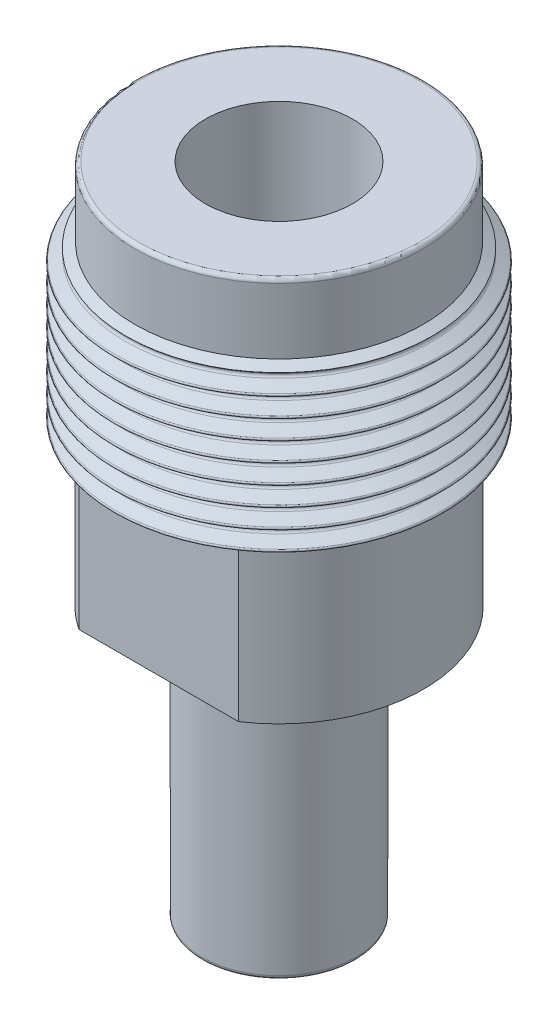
ISO-10303-21;
HEADER;
FILE_DESCRIPTION(('STEP AP214'),'2;1');
FILE_NAME('part.step','',(''),(''),'','','');
FILE_SCHEMA(('AUTOMOTIVE_DESIGN { 1 0 10303 214 1 1 1 1 }'));
ENDSEC;
DATA;
#1=APPLICATION_CONTEXT('core data for automotive mechanical design processes');
#2=APPLICATION_PROTOCOL_DEFINITION('international standard','automotive_design',2000,#1);
#3=PRODUCT_CONTEXT('',#1,'mechanical');
#4=PRODUCT('Part','Part','',(#3));
#5=PRODUCT_RELATED_PRODUCT_CATEGORY('part','',(#4));
#6=PRODUCT_DEFINITION_FORMATION('','',#4);
#7=PRODUCT_DEFINITION_CONTEXT('part definition',#1,'design');
#8=PRODUCT_DEFINITION('design','',#6,#7);
#9=PRODUCT_DEFINITION_SHAPE('','',#8);
#10=(LENGTH_UNIT() NAMED_UNIT(*) SI_UNIT(.MILLI.,.METRE.));
#11=(NAMED_UNIT(*) PLANE_ANGLE_UNIT() SI_UNIT($,.RADIAN.));
#12=(NAMED_UNIT(*) SI_UNIT($,.STERADIAN.) SOLID_ANGLE_UNIT());
#13=UNCERTAINTY_MEASURE_WITH_UNIT(LENGTH_MEASURE(1.E-05),#10,'distance_accuracy_value','');
#14=(GEOMETRIC_REPRESENTATION_CONTEXT(3) GLOBAL_UNCERTAINTY_ASSIGNED_CONTEXT((#13)) GLOBAL_UNIT_ASSIGNED_CONTEXT((#10,
#11,#12)) REPRESENTATION_CONTEXT('',''));
#15=CARTESIAN_POINT('',(0.,0.,0.));
#16=DIRECTION('',(0.,0.,1.));
#17=DIRECTION('',(1.,0.,0.));
#18=AXIS2_PLACEMENT_3D('',#15,#16,#17);
#19=CARTESIAN_POINT('',(-2.4257,0.,0.));
#20=DIRECTION('',(0.,1.,0.));
#21=DIRECTION('',(0.,0.,1.));
#22=AXIS2_PLACEMENT_3D('',#19,#20,#21);
#23=PLANE('',#22);
#24=CARTESIAN_POINT('',(0.,0.,0.));
#25=DIRECTION('',(0.,1.,0.));
#26=DIRECTION('',(0.,0.,1.));
#27=AXIS2_PLACEMENT_3D('',#24,#25,#26);
#28=CIRCLE('',#27,4.6228);
#29=CARTESIAN_POINT('',(0.,0.,4.6228));
#30=VERTEX_POINT('',#29);
#31=EDGE_CURVE('E11',#30,#30,#28,.T.);
#32=ORIENTED_EDGE('',*,*,#31,.T.);
#33=EDGE_LOOP('',(#32));
#34=FACE_BOUND('',#33,.T.);
#35=CARTESIAN_POINT('',(0.,0.,0.));
#36=DIRECTION('',(0.,1.,0.));
#37=DIRECTION('',(0.,0.,1.));
#38=AXIS2_PLACEMENT_3D('',#35,#36,#37);
#39=CIRCLE('',#38,2.4257);
#40=CARTESIAN_POINT('',(0.,0.,2.4257));
#41=VERTEX_POINT('',#40);
#42=EDGE_CURVE('E96',#41,#41,#39,.T.);
#43=ORIENTED_EDGE('',*,*,#42,.F.);
#44=EDGE_LOOP('',(#43));
#45=FACE_BOUND('',#44,.T.);
#46=ADVANCED_FACE('F32',(#34,#45),#23,.T.);
#47=CARTESIAN_POINT('',(0.,-2.54,0.));
#48=DIRECTION('',(0.,-1.,0.));
#49=DIRECTION('',(0.,0.,-1.));
#50=AXIS2_PLACEMENT_3D('',#47,#48,#49);
#51=TOROIDAL_SURFACE('',#50,5.10210975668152,0.091654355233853);
#52=CARTESIAN_POINT('',(0.,-2.619375,0.));
#53=DIRECTION('',(0.,-1.,0.));
#54=DIRECTION('',(0.,0.,-1.));
#55=AXIS2_PLACEMENT_3D('',#52,#53,#54);
#56=CIRCLE('',#55,5.05628257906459);
#57=CARTESIAN_POINT('',(0.,-2.619375,-5.05628257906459));
#58=VERTEX_POINT('',#57);
#59=EDGE_CURVE('E191',#58,#58,#56,.T.);
#60=ORIENTED_EDGE('',*,*,#59,.F.);
#61=EDGE_LOOP('',(#60));
#62=FACE_BOUND('',#61,.T.);
#63=CARTESIAN_POINT('',(0.,-2.46180315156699,0.));
#64=DIRECTION('',(0.,-1.,0.));
#65=DIRECTION('',(0.,0.,-1.));
#66=AXIS2_PLACEMENT_3D('',#63,#64,#65);
#67=CIRCLE('',#66,5.05429999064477);
#68=CARTESIAN_POINT('',(0.,-2.46180315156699,-5.05429999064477));
#69=VERTEX_POINT('',#68);
#70=EDGE_CURVE('E79',#69,#69,#67,.T.);
#71=ORIENTED_EDGE('',*,*,#70,.T.);
#72=EDGE_LOOP('',(#71));
#73=FACE_BOUND('',#72,.T.);
#74=ADVANCED_FACE('F142',(#62,#73),#51,.F.);
#75=CARTESIAN_POINT('',(0.,0.,0.));
#76=DIRECTION('',(0.,1.,0.));
#77=DIRECTION('',(0.,0.,1.));
#78=AXIS2_PLACEMENT_3D('',#75,#76,#77);
#79=CYLINDRICAL_SURFACE('',#78,4.7625);
#80=CARTESIAN_POINT('',(0.,-7.62,0.));
#81=DIRECTION('',(0.,1.,0.));
#82=DIRECTION('',(0.,0.,1.));
#83=AXIS2_PLACEMENT_3D('',#80,#81,#82);
#84=CIRCLE('',#83,4.7625);
#85=CARTESIAN_POINT('',(-2.6325709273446,-7.62,-3.96875));
#86=VERTEX_POINT('',#85);
#87=CARTESIAN_POINT('',(-2.6325709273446,-7.62,3.96875));
#88=VERTEX_POINT('',#87);
#89=EDGE_CURVE('E97',#86,#88,#84,.T.);
#90=ORIENTED_EDGE('',*,*,#89,.F.);
#91=DIRECTION('',(0.,1.,0.));
#92=VECTOR('',#91,1.);
#93=CARTESIAN_POINT('',(-2.6325709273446,-15.24,-3.96875));
#94=LINE('',#93,#92);
#95=CARTESIAN_POINT('',(-2.6325709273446,-12.7,-3.96875));
#96=VERTEX_POINT('',#95);
#97=EDGE_CURVE('E77',#96,#86,#94,.T.);
#98=ORIENTED_EDGE('',*,*,#97,.F.);
#99=CARTESIAN_POINT('',(0.,-12.7,0.));
#100=DIRECTION('',(0.,1.,0.));
#101=DIRECTION('',(0.,0.,1.));
#102=AXIS2_PLACEMENT_3D('',#99,#100,#101);
#103=CIRCLE('',#102,4.7625);
#104=CARTESIAN_POINT('',(-2.6325709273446,-12.7,3.96875));
#105=VERTEX_POINT('',#104);
#106=EDGE_CURVE('E55',#96,#105,#103,.T.);
#107=ORIENTED_EDGE('',*,*,#106,.T.);
#108=DIRECTION('',(0.,1.,0.));
#109=VECTOR('',#108,1.);
#110=CARTESIAN_POINT('',(-2.6325709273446,-15.24,3.96875));
#111=LINE('',#110,#109);
#112=EDGE_CURVE('E285',#105,#88,#111,.T.);
#113=ORIENTED_EDGE('',*,*,#112,.T.);
#114=EDGE_LOOP('',(#90,#98,#107,#113));
#115=FACE_BOUND('',#114,.T.);
#116=ADVANCED_FACE('F148',(#115),#79,.T.);
#117=CARTESIAN_POINT('',(2.6325709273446,-12.7,3.96875));
#118=VERTEX_POINT('',#117);
#119=CARTESIAN_POINT('',(2.6325709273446,-12.7,-3.96875));
#120=VERTEX_POINT('',#119);
#121=EDGE_CURVE('E88',#118,#120,#103,.T.);
#122=ORIENTED_EDGE('',*,*,#121,.T.);
#123=DIRECTION('',(0.,1.,0.));
#124=VECTOR('',#123,1.);
#125=CARTESIAN_POINT('',(2.6325709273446,-15.24,-3.96875));
#126=LINE('',#125,#124);
#127=CARTESIAN_POINT('',(2.6325709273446,-7.62,-3.96875));
#128=VERTEX_POINT('',#127);
#129=EDGE_CURVE('E75',#120,#128,#126,.T.);
#130=ORIENTED_EDGE('',*,*,#129,.T.);
#131=CARTESIAN_POINT('',(2.6325709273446,-7.62,3.96875));
#132=VERTEX_POINT('',#131);
#133=EDGE_CURVE('E86',#132,#128,#84,.T.);
#134=ORIENTED_EDGE('',*,*,#133,.F.);
#135=DIRECTION('',(0.,1.,0.));
#136=VECTOR('',#135,1.);
#137=CARTESIAN_POINT('',(2.6325709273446,-15.24,3.96875));
#138=LINE('',#137,#136);
#139=EDGE_CURVE('E287',#118,#132,#138,.T.);
#140=ORIENTED_EDGE('',*,*,#139,.F.);
#141=EDGE_LOOP('',(#122,#130,#134,#140));
#142=FACE_BOUND('',#141,.T.);
#143=ADVANCED_FACE('F84',(#142),#79,.T.);
#144=CARTESIAN_POINT('',(-3.3274,-12.7,0.));
#145=DIRECTION('',(0.,-1.,0.));
#146=DIRECTION('',(0.,0.,-1.));
#147=AXIS2_PLACEMENT_3D('',#144,#145,#146);
#148=PLANE('',#147);
#149=CARTESIAN_POINT('',(0.,-12.7,0.));
#150=DIRECTION('',(0.,1.,0.));
#151=DIRECTION('',(0.,0.,1.));
#152=AXIS2_PLACEMENT_3D('',#149,#150,#151);
#153=CIRCLE('',#152,3.3274);
#154=CARTESIAN_POINT('',(0.,-12.7,3.3274));
#155=VERTEX_POINT('',#154);
#156=EDGE_CURVE('E181',#155,#155,#153,.T.);
#157=ORIENTED_EDGE('',*,*,#156,.T.);
#158=EDGE_LOOP('',(#157));
#159=FACE_BOUND('',#158,.T.);
#160=ORIENTED_EDGE('',*,*,#106,.F.);
#161=DIRECTION('',(1.,0.,0.));
#162=VECTOR('',#161,1.);
#163=CARTESIAN_POINT('',(-3.3274,-12.7,-3.96875));
#164=LINE('',#163,#162);
#165=EDGE_CURVE('E89',#96,#120,#164,.T.);
#166=ORIENTED_EDGE('',*,*,#165,.T.);
#167=ORIENTED_EDGE('',*,*,#121,.F.);
#168=DIRECTION('',(-1.,0.,0.));
#169=VECTOR('',#168,1.);
#170=CARTESIAN_POINT('',(-3.3274,-12.7,3.96875));
#171=LINE('',#170,#169);
#172=EDGE_CURVE('E100',#118,#105,#171,.T.);
#173=ORIENTED_EDGE('',*,*,#172,.T.);
#174=EDGE_LOOP('',(#160,#166,#167,#173));
#175=FACE_BOUND('',#174,.T.);
#176=ADVANCED_FACE('F447',(#159,#175),#148,.T.);
#177=CARTESIAN_POINT('',(-4.7625,-7.62,0.));
#178=DIRECTION('',(0.,-1.,0.));
#179=DIRECTION('',(0.,0.,-1.));
#180=AXIS2_PLACEMENT_3D('',#177,#178,#179);
#181=PLANE('',#180);
#182=ORIENTED_EDGE('',*,*,#133,.T.);
#183=DIRECTION('',(1.,0.,0.));
#184=VECTOR('',#183,1.);
#185=CARTESIAN_POINT('',(-2.6325709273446,-7.62,-3.96875));
#186=LINE('',#185,#184);
#187=EDGE_CURVE('E47',#86,#128,#186,.T.);
#188=ORIENTED_EDGE('',*,*,#187,.F.);
#189=ORIENTED_EDGE('',*,*,#89,.T.);
#190=DIRECTION('',(-1.,0.,0.));
#191=VECTOR('',#190,1.);
#192=CARTESIAN_POINT('',(-2.6325709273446,-7.62,3.96875));
#193=LINE('',#192,#191);
#194=EDGE_CURVE('E95',#132,#88,#193,.T.);
#195=ORIENTED_EDGE('',*,*,#194,.F.);
#196=EDGE_LOOP('',(#182,#188,#189,#195));
#197=FACE_BOUND('',#196,.T.);
#198=CARTESIAN_POINT('',(0.,-7.62,0.));
#199=DIRECTION('',(0.,1.,0.));
#200=DIRECTION('',(0.,0.,1.));
#201=AXIS2_PLACEMENT_3D('',#198,#199,#200);
#202=CIRCLE('',#201,5.01045540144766);
#203=CARTESIAN_POINT('',(0.,-7.62,5.01045540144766));
#204=VERTEX_POINT('',#203);
#205=EDGE_CURVE('E105',#204,#204,#202,.F.);
#206=ORIENTED_EDGE('',*,*,#205,.T.);
#207=EDGE_LOOP('',(#206));
#208=FACE_BOUND('',#207,.T.);
#209=ADVANCED_FACE('F92',(#197,#208),#181,.T.);
#210=CARTESIAN_POINT('',(0.,0.,0.));
#211=DIRECTION('',(0.,1.,0.));
#212=DIRECTION('',(0.,0.,1.));
#213=AXIS2_PLACEMENT_3D('',#210,#211,#212);
#214=CYLINDRICAL_SURFACE('',#213,2.4257);
#215=ORIENTED_EDGE('',*,*,#42,.T.);
#216=EDGE_LOOP('',(#215));
#217=FACE_BOUND('',#216,.T.);
#218=CARTESIAN_POINT('',(0.,-3.81,0.));
#219=DIRECTION('',(0.,1.,0.));
#220=DIRECTION('',(0.,0.,1.));
#221=AXIS2_PLACEMENT_3D('',#218,#219,#220);
#222=CIRCLE('',#221,2.4257);
#223=CARTESIAN_POINT('',(0.,-3.81,2.4257));
#224=VERTEX_POINT('',#223);
#225=EDGE_CURVE('E186',#224,#224,#222,.T.);
#226=ORIENTED_EDGE('',*,*,#225,.F.);
#227=EDGE_LOOP('',(#226));
#228=FACE_BOUND('',#227,.T.);
#229=ADVANCED_FACE('F155',(#217,#228),#214,.F.);
#230=CARTESIAN_POINT('',(0.,-13.4874,0.));
#231=DIRECTION('',(0.,1.,0.));
#232=DIRECTION('',(0.,0.,1.));
#233=AXIS2_PLACEMENT_3D('',#230,#231,#232);
#234=TOROIDAL_SURFACE('',#233,3.3274,0.7874);
#235=CARTESIAN_POINT('',(0.,-13.4874,0.));
#236=DIRECTION('',(0.,1.,0.));
#237=DIRECTION('',(0.,0.,1.));
#238=AXIS2_PLACEMENT_3D('',#235,#236,#237);
#239=CIRCLE('',#238,2.54);
#240=CARTESIAN_POINT('',(0.,-13.4874,2.54));
#241=VERTEX_POINT('',#240);
#242=EDGE_CURVE('E179',#241,#241,#239,.T.);
#243=ORIENTED_EDGE('',*,*,#242,.T.);
#244=EDGE_LOOP('',(#243));
#245=FACE_BOUND('',#244,.T.);
#246=ORIENTED_EDGE('',*,*,#156,.F.);
#247=EDGE_LOOP('',(#246));
#248=FACE_BOUND('',#247,.T.);
#249=ADVANCED_FACE('F158',(#245,#248),#234,.F.);
#250=CARTESIAN_POINT('',(0.,0.,0.));
#251=DIRECTION('',(0.,1.,0.));
#252=DIRECTION('',(0.,0.,1.));
#253=AXIS2_PLACEMENT_3D('',#250,#251,#252);
#254=CYLINDRICAL_SURFACE('',#253,2.54);
#255=CARTESIAN_POINT('',(0.,-21.463,0.));
#256=DIRECTION('',(0.,-1.,0.));
#257=DIRECTION('',(0.,0.,-1.));
#258=AXIS2_PLACEMENT_3D('',#255,#256,#257);
#259=CIRCLE('',#258,2.54);
#260=CARTESIAN_POINT('',(0.,-21.463,-2.54));
#261=VERTEX_POINT('',#260);
#262=EDGE_CURVE('E112',#261,#261,#259,.F.);
#263=ORIENTED_EDGE('',*,*,#262,.T.);
#264=EDGE_LOOP('',(#263));
#265=FACE_BOUND('',#264,.T.);
#266=ORIENTED_EDGE('',*,*,#242,.F.);
#267=EDGE_LOOP('',(#266));
#268=FACE_BOUND('',#267,.T.);
#269=ADVANCED_FACE('F172',(#265,#268),#254,.T.);
#270=CARTESIAN_POINT('',(-1.905,-21.59,0.));
#271=DIRECTION('',(0.,-1.,0.));
#272=DIRECTION('',(0.,0.,-1.));
#273=AXIS2_PLACEMENT_3D('',#270,#271,#272);
#274=PLANE('',#273);
#275=CARTESIAN_POINT('',(0.,-21.59,0.));
#276=DIRECTION('',(0.,-1.,0.));
#277=DIRECTION('',(0.,0.,-1.));
#278=AXIS2_PLACEMENT_3D('',#275,#276,#277);
#279=CIRCLE('',#278,2.413);
#280=CARTESIAN_POINT('',(0.,-21.59,-2.413));
#281=VERTEX_POINT('',#280);
#282=EDGE_CURVE('E121',#281,#281,#279,.T.);
#283=ORIENTED_EDGE('',*,*,#282,.T.);
#284=EDGE_LOOP('',(#283));
#285=FACE_BOUND('',#284,.T.);
#286=CARTESIAN_POINT('',(0.,-21.59,0.));
#287=DIRECTION('',(0.,-1.,0.));
#288=DIRECTION('',(0.,0.,-1.));
#289=AXIS2_PLACEMENT_3D('',#286,#287,#288);
#290=CIRCLE('',#289,2.032);
#291=CARTESIAN_POINT('',(0.,-21.59,-2.032));
#292=VERTEX_POINT('',#291);
#293=EDGE_CURVE('E118',#292,#292,#290,.F.);
#294=ORIENTED_EDGE('',*,*,#293,.T.);
#295=EDGE_LOOP('',(#294));
#296=FACE_BOUND('',#295,.T.);
#297=ADVANCED_FACE('F175',(#285,#296),#274,.T.);
#298=CARTESIAN_POINT('',(0.,0.,0.));
#299=DIRECTION('',(0.,1.,0.));
#300=DIRECTION('',(0.,0.,1.));
#301=AXIS2_PLACEMENT_3D('',#298,#299,#300);
#302=CYLINDRICAL_SURFACE('',#301,1.905);
#303=CARTESIAN_POINT('',(0.,-21.463,0.));
#304=DIRECTION('',(0.,-1.,0.));
#305=DIRECTION('',(0.,0.,-1.));
#306=AXIS2_PLACEMENT_3D('',#303,#304,#305);
#307=CIRCLE('',#306,1.905);
#308=CARTESIAN_POINT('',(0.,-21.463,-1.905));
#309=VERTEX_POINT('',#308);
#310=EDGE_CURVE('E124',#309,#309,#307,.T.);
#311=ORIENTED_EDGE('',*,*,#310,.T.);
#312=EDGE_LOOP('',(#311));
#313=FACE_BOUND('',#312,.T.);
#314=CARTESIAN_POINT('',(0.,-4.12286812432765,0.));
#315=DIRECTION('',(0.,1.,0.));
#316=DIRECTION('',(0.,0.,1.));
#317=AXIS2_PLACEMENT_3D('',#314,#315,#316);
#318=CIRCLE('',#317,1.905);
#319=CARTESIAN_POINT('',(0.,-4.12286812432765,1.905));
#320=VERTEX_POINT('',#319);
#321=EDGE_CURVE('E182',#320,#320,#318,.T.);
#322=ORIENTED_EDGE('',*,*,#321,.T.);
#323=EDGE_LOOP('',(#322));
#324=FACE_BOUND('',#323,.T.);
#325=ADVANCED_FACE('F437',(#313,#324),#302,.F.);
#326=CARTESIAN_POINT('',(0.,-4.12286812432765,0.));
#327=DIRECTION('',(0.,1.,0.));
#328=DIRECTION('',(0.,0.,1.));
#329=AXIS2_PLACEMENT_3D('',#326,#327,#328);
#330=CONICAL_SURFACE('',#329,1.905,1.02974425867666);
#331=ORIENTED_EDGE('',*,*,#225,.T.);
#332=EDGE_LOOP('',(#331));
#333=FACE_BOUND('',#332,.T.);
#334=ORIENTED_EDGE('',*,*,#321,.F.);
#335=EDGE_LOOP('',(#334));
#336=FACE_BOUND('',#335,.T.);
#337=ADVANCED_FACE('F432',(#333,#336),#330,.F.);
#338=CARTESIAN_POINT('',(0.,-2.8178125,0.));
#339=DIRECTION('',(0.,-1.,0.));
#340=DIRECTION('',(0.,0.,-1.));
#341=AXIS2_PLACEMENT_3D('',#338,#339,#340);
#342=CONICAL_SURFACE('',#341,5.39998641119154,1.0471975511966);
#343=ORIENTED_EDGE('',*,*,#59,.T.);
#344=EDGE_LOOP('',(#343));
#345=FACE_BOUND('',#344,.T.);
#346=CARTESIAN_POINT('',(0.,-2.8178125,0.));
#347=DIRECTION('',(0.,-1.,0.));
#348=DIRECTION('',(0.,0.,-1.));
#349=AXIS2_PLACEMENT_3D('',#346,#347,#348);
#350=CIRCLE('',#349,5.39998641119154);
#351=CARTESIAN_POINT('',(0.,-2.8178125,-5.39998641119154));
#352=VERTEX_POINT('',#351);
#353=EDGE_CURVE('E194',#352,#352,#350,.T.);
#354=ORIENTED_EDGE('',*,*,#353,.F.);
#355=EDGE_LOOP('',(#354));
#356=FACE_BOUND('',#355,.T.);
#357=ADVANCED_FACE('F429',(#345,#356),#342,.T.);
#358=CARTESIAN_POINT('',(0.,-2.8575,0.));
#359=DIRECTION('',(0.,-1.,0.));
#360=DIRECTION('',(0.,0.,-1.));
#361=AXIS2_PLACEMENT_3D('',#358,#359,#360);
#362=TOROIDAL_SURFACE('',#361,5.37707282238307,0.0458271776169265);
#363=ORIENTED_EDGE('',*,*,#353,.T.);
#364=EDGE_LOOP('',(#363));
#365=FACE_BOUND('',#364,.T.);
#366=CARTESIAN_POINT('',(0.,-2.8971875,0.));
#367=DIRECTION('',(0.,-1.,0.));
#368=DIRECTION('',(0.,0.,-1.));
#369=AXIS2_PLACEMENT_3D('',#366,#367,#368);
#370=CIRCLE('',#369,5.39998641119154);
#371=CARTESIAN_POINT('',(0.,-2.8971875,-5.39998641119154));
#372=VERTEX_POINT('',#371);
#373=EDGE_CURVE('E197',#372,#372,#370,.T.);
#374=ORIENTED_EDGE('',*,*,#373,.F.);
#375=EDGE_LOOP('',(#374));
#376=FACE_BOUND('',#375,.T.);
#377=ADVANCED_FACE('F425',(#365,#376),#362,.T.);
#378=CARTESIAN_POINT('',(0.,-3.095625,0.));
#379=DIRECTION('',(0.,1.,0.));
#380=DIRECTION('',(0.,0.,1.));
#381=AXIS2_PLACEMENT_3D('',#378,#379,#380);
#382=CONICAL_SURFACE('',#381,5.05628257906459,1.04719755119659);
#383=ORIENTED_EDGE('',*,*,#373,.T.);
#384=EDGE_LOOP('',(#383));
#385=FACE_BOUND('',#384,.T.);
#386=CARTESIAN_POINT('',(0.,-3.095625,0.));
#387=DIRECTION('',(0.,-1.,0.));
#388=DIRECTION('',(0.,0.,-1.));
#389=AXIS2_PLACEMENT_3D('',#386,#387,#388);
#390=CIRCLE('',#389,5.05628257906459);
#391=CARTESIAN_POINT('',(0.,-3.095625,-5.05628257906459));
#392=VERTEX_POINT('',#391);
#393=EDGE_CURVE('E200',#392,#392,#390,.T.);
#394=ORIENTED_EDGE('',*,*,#393,.F.);
#395=EDGE_LOOP('',(#394));
#396=FACE_BOUND('',#395,.T.);
#397=ADVANCED_FACE('F421',(#385,#396),#382,.T.);
#398=CARTESIAN_POINT('',(0.,-3.175,0.));
#399=DIRECTION('',(0.,-1.,0.));
#400=DIRECTION('',(0.,0.,-1.));
#401=AXIS2_PLACEMENT_3D('',#398,#399,#400);
#402=TOROIDAL_SURFACE('',#401,5.10210975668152,0.091654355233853);
#403=ORIENTED_EDGE('',*,*,#393,.T.);
#404=EDGE_LOOP('',(#403));
#405=FACE_BOUND('',#404,.T.);
#406=CARTESIAN_POINT('',(0.,-3.254375,0.));
#407=DIRECTION('',(0.,-1.,0.));
#408=DIRECTION('',(0.,0.,-1.));
#409=AXIS2_PLACEMENT_3D('',#406,#407,#408);
#410=CIRCLE('',#409,5.05628257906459);
#411=CARTESIAN_POINT('',(0.,-3.254375,-5.05628257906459));
#412=VERTEX_POINT('',#411);
#413=EDGE_CURVE('E203',#412,#412,#410,.T.);
#414=ORIENTED_EDGE('',*,*,#413,.F.);
#415=EDGE_LOOP('',(#414));
#416=FACE_BOUND('',#415,.T.);
#417=ADVANCED_FACE('F417',(#405,#416),#402,.F.);
#418=CARTESIAN_POINT('',(0.,-3.4528125,0.));
#419=DIRECTION('',(0.,-1.,0.));
#420=DIRECTION('',(0.,0.,-1.));
#421=AXIS2_PLACEMENT_3D('',#418,#419,#420);
#422=CONICAL_SURFACE('',#421,5.39998641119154,1.0471975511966);
#423=ORIENTED_EDGE('',*,*,#413,.T.);
#424=EDGE_LOOP('',(#423));
#425=FACE_BOUND('',#424,.T.);
#426=CARTESIAN_POINT('',(0.,-3.4528125,0.));
#427=DIRECTION('',(0.,-1.,0.));
#428=DIRECTION('',(0.,0.,-1.));
#429=AXIS2_PLACEMENT_3D('',#426,#427,#428);
#430=CIRCLE('',#429,5.39998641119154);
#431=CARTESIAN_POINT('',(0.,-3.4528125,-5.39998641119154));
#432=VERTEX_POINT('',#431);
#433=EDGE_CURVE('E206',#432,#432,#430,.T.);
#434=ORIENTED_EDGE('',*,*,#433,.F.);
#435=EDGE_LOOP('',(#434));
#436=FACE_BOUND('',#435,.T.);
#437=ADVANCED_FACE('F413',(#425,#436),#422,.T.);
#438=CARTESIAN_POINT('',(0.,-3.4925,0.));
#439=DIRECTION('',(0.,-1.,0.));
#440=DIRECTION('',(0.,0.,-1.));
#441=AXIS2_PLACEMENT_3D('',#438,#439,#440);
#442=TOROIDAL_SURFACE('',#441,5.37707282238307,0.0458271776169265);
#443=ORIENTED_EDGE('',*,*,#433,.T.);
#444=EDGE_LOOP('',(#443));
#445=FACE_BOUND('',#444,.T.);
#446=CARTESIAN_POINT('',(0.,-3.5321875,0.));
#447=DIRECTION('',(0.,-1.,0.));
#448=DIRECTION('',(0.,0.,-1.));
#449=AXIS2_PLACEMENT_3D('',#446,#447,#448);
#450=CIRCLE('',#449,5.39998641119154);
#451=CARTESIAN_POINT('',(0.,-3.5321875,-5.39998641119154));
#452=VERTEX_POINT('',#451);
#453=EDGE_CURVE('E209',#452,#452,#450,.T.);
#454=ORIENTED_EDGE('',*,*,#453,.F.);
#455=EDGE_LOOP('',(#454));
#456=FACE_BOUND('',#455,.T.);
#457=ADVANCED_FACE('F409',(#445,#456),#442,.T.);
#458=CARTESIAN_POINT('',(0.,-3.730625,0.));
#459=DIRECTION('',(0.,1.,0.));
#460=DIRECTION('',(0.,0.,1.));
#461=AXIS2_PLACEMENT_3D('',#458,#459,#460);
#462=CONICAL_SURFACE('',#461,5.05628257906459,1.04719755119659);
#463=ORIENTED_EDGE('',*,*,#453,.T.);
#464=EDGE_LOOP('',(#463));
#465=FACE_BOUND('',#464,.T.);
#466=CARTESIAN_POINT('',(0.,-3.730625,0.));
#467=DIRECTION('',(0.,-1.,0.));
#468=DIRECTION('',(0.,0.,-1.));
#469=AXIS2_PLACEMENT_3D('',#466,#467,#468);
#470=CIRCLE('',#469,5.05628257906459);
#471=CARTESIAN_POINT('',(0.,-3.730625,-5.05628257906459));
#472=VERTEX_POINT('',#471);
#473=EDGE_CURVE('E212',#472,#472,#470,.T.);
#474=ORIENTED_EDGE('',*,*,#473,.F.);
#475=EDGE_LOOP('',(#474));
#476=FACE_BOUND('',#475,.T.);
#477=ADVANCED_FACE('F405',(#465,#476),#462,.T.);
#478=CARTESIAN_POINT('',(0.,-3.81,0.));
#479=DIRECTION('',(0.,-1.,0.));
#480=DIRECTION('',(0.,0.,-1.));
#481=AXIS2_PLACEMENT_3D('',#478,#479,#480);
#482=TOROIDAL_SURFACE('',#481,5.10210975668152,0.091654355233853);
#483=ORIENTED_EDGE('',*,*,#473,.T.);
#484=EDGE_LOOP('',(#483));
#485=FACE_BOUND('',#484,.T.);
#486=CARTESIAN_POINT('',(0.,-3.889375,0.));
#487=DIRECTION('',(0.,-1.,0.));
#488=DIRECTION('',(0.,0.,-1.));
#489=AXIS2_PLACEMENT_3D('',#486,#487,#488);
#490=CIRCLE('',#489,5.05628257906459);
#491=CARTESIAN_POINT('',(0.,-3.889375,-5.05628257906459));
#492=VERTEX_POINT('',#491);
#493=EDGE_CURVE('E215',#492,#492,#490,.T.);
#494=ORIENTED_EDGE('',*,*,#493,.F.);
#495=EDGE_LOOP('',(#494));
#496=FACE_BOUND('',#495,.T.);
#497=ADVANCED_FACE('F401',(#485,#496),#482,.F.);
#498=CARTESIAN_POINT('',(0.,-4.0878125,0.));
#499=DIRECTION('',(0.,-1.,0.));
#500=DIRECTION('',(0.,0.,-1.));
#501=AXIS2_PLACEMENT_3D('',#498,#499,#500);
#502=CONICAL_SURFACE('',#501,5.39998641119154,1.0471975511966);
#503=ORIENTED_EDGE('',*,*,#493,.T.);
#504=EDGE_LOOP('',(#503));
#505=FACE_BOUND('',#504,.T.);
#506=CARTESIAN_POINT('',(0.,-4.0878125,0.));
#507=DIRECTION('',(0.,-1.,0.));
#508=DIRECTION('',(0.,0.,-1.));
#509=AXIS2_PLACEMENT_3D('',#506,#507,#508);
#510=CIRCLE('',#509,5.39998641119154);
#511=CARTESIAN_POINT('',(0.,-4.0878125,-5.39998641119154));
#512=VERTEX_POINT('',#511);
#513=EDGE_CURVE('E218',#512,#512,#510,.T.);
#514=ORIENTED_EDGE('',*,*,#513,.F.);
#515=EDGE_LOOP('',(#514));
#516=FACE_BOUND('',#515,.T.);
#517=ADVANCED_FACE('F397',(#505,#516),#502,.T.);
#518=CARTESIAN_POINT('',(0.,-4.1275,0.));
#519=DIRECTION('',(0.,-1.,0.));
#520=DIRECTION('',(0.,0.,-1.));
#521=AXIS2_PLACEMENT_3D('',#518,#519,#520);
#522=TOROIDAL_SURFACE('',#521,5.37707282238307,0.0458271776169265);
#523=ORIENTED_EDGE('',*,*,#513,.T.);
#524=EDGE_LOOP('',(#523));
#525=FACE_BOUND('',#524,.T.);
#526=CARTESIAN_POINT('',(0.,-4.1671875,0.));
#527=DIRECTION('',(0.,-1.,0.));
#528=DIRECTION('',(0.,0.,-1.));
#529=AXIS2_PLACEMENT_3D('',#526,#527,#528);
#530=CIRCLE('',#529,5.39998641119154);
#531=CARTESIAN_POINT('',(0.,-4.1671875,-5.39998641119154));
#532=VERTEX_POINT('',#531);
#533=EDGE_CURVE('E221',#532,#532,#530,.T.);
#534=ORIENTED_EDGE('',*,*,#533,.F.);
#535=EDGE_LOOP('',(#534));
#536=FACE_BOUND('',#535,.T.);
#537=ADVANCED_FACE('F393',(#525,#536),#522,.T.);
#538=CARTESIAN_POINT('',(0.,-4.365625,0.));
#539=DIRECTION('',(0.,1.,0.));
#540=DIRECTION('',(0.,0.,1.));
#541=AXIS2_PLACEMENT_3D('',#538,#539,#540);
#542=CONICAL_SURFACE('',#541,5.05628257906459,1.04719755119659);
#543=ORIENTED_EDGE('',*,*,#533,.T.);
#544=EDGE_LOOP('',(#543));
#545=FACE_BOUND('',#544,.T.);
#546=CARTESIAN_POINT('',(0.,-4.365625,0.));
#547=DIRECTION('',(0.,-1.,0.));
#548=DIRECTION('',(0.,0.,-1.));
#549=AXIS2_PLACEMENT_3D('',#546,#547,#548);
#550=CIRCLE('',#549,5.05628257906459);
#551=CARTESIAN_POINT('',(0.,-4.365625,-5.05628257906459));
#552=VERTEX_POINT('',#551);
#553=EDGE_CURVE('E224',#552,#552,#550,.T.);
#554=ORIENTED_EDGE('',*,*,#553,.F.);
#555=EDGE_LOOP('',(#554));
#556=FACE_BOUND('',#555,.T.);
#557=ADVANCED_FACE('F389',(#545,#556),#542,.T.);
#558=CARTESIAN_POINT('',(0.,-4.445,0.));
#559=DIRECTION('',(0.,-1.,0.));
#560=DIRECTION('',(0.,0.,-1.));
#561=AXIS2_PLACEMENT_3D('',#558,#559,#560);
#562=TOROIDAL_SURFACE('',#561,5.10210975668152,0.091654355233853);
#563=ORIENTED_EDGE('',*,*,#553,.T.);
#564=EDGE_LOOP('',(#563));
#565=FACE_BOUND('',#564,.T.);
#566=CARTESIAN_POINT('',(0.,-4.524375,0.));
#567=DIRECTION('',(0.,-1.,0.));
#568=DIRECTION('',(0.,0.,-1.));
#569=AXIS2_PLACEMENT_3D('',#566,#567,#568);
#570=CIRCLE('',#569,5.05628257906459);
#571=CARTESIAN_POINT('',(0.,-4.524375,-5.05628257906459));
#572=VERTEX_POINT('',#571);
#573=EDGE_CURVE('E227',#572,#572,#570,.T.);
#574=ORIENTED_EDGE('',*,*,#573,.F.);
#575=EDGE_LOOP('',(#574));
#576=FACE_BOUND('',#575,.T.);
#577=ADVANCED_FACE('F385',(#565,#576),#562,.F.);
#578=CARTESIAN_POINT('',(0.,-4.7228125,0.));
#579=DIRECTION('',(0.,-1.,0.));
#580=DIRECTION('',(0.,0.,-1.));
#581=AXIS2_PLACEMENT_3D('',#578,#579,#580);
#582=CONICAL_SURFACE('',#581,5.39998641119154,1.0471975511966);
#583=ORIENTED_EDGE('',*,*,#573,.T.);
#584=EDGE_LOOP('',(#583));
#585=FACE_BOUND('',#584,.T.);
#586=CARTESIAN_POINT('',(0.,-4.7228125,0.));
#587=DIRECTION('',(0.,-1.,0.));
#588=DIRECTION('',(0.,0.,-1.));
#589=AXIS2_PLACEMENT_3D('',#586,#587,#588);
#590=CIRCLE('',#589,5.39998641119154);
#591=CARTESIAN_POINT('',(0.,-4.7228125,-5.39998641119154));
#592=VERTEX_POINT('',#591);
#593=EDGE_CURVE('E230',#592,#592,#590,.T.);
#594=ORIENTED_EDGE('',*,*,#593,.F.);
#595=EDGE_LOOP('',(#594));
#596=FACE_BOUND('',#595,.T.);
#597=ADVANCED_FACE('F381',(#585,#596),#582,.T.);
#598=CARTESIAN_POINT('',(0.,-4.7625,0.));
#599=DIRECTION('',(0.,-1.,0.));
#600=DIRECTION('',(0.,0.,-1.));
#601=AXIS2_PLACEMENT_3D('',#598,#599,#600);
#602=TOROIDAL_SURFACE('',#601,5.37707282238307,0.0458271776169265);
#603=ORIENTED_EDGE('',*,*,#593,.T.);
#604=EDGE_LOOP('',(#603));
#605=FACE_BOUND('',#604,.T.);
#606=CARTESIAN_POINT('',(0.,-4.8021875,0.));
#607=DIRECTION('',(0.,-1.,0.));
#608=DIRECTION('',(0.,0.,-1.));
#609=AXIS2_PLACEMENT_3D('',#606,#607,#608);
#610=CIRCLE('',#609,5.39998641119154);
#611=CARTESIAN_POINT('',(0.,-4.8021875,-5.39998641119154));
#612=VERTEX_POINT('',#611);
#613=EDGE_CURVE('E233',#612,#612,#610,.T.);
#614=ORIENTED_EDGE('',*,*,#613,.F.);
#615=EDGE_LOOP('',(#614));
#616=FACE_BOUND('',#615,.T.);
#617=ADVANCED_FACE('F377',(#605,#616),#602,.T.);
#618=CARTESIAN_POINT('',(0.,-5.000625,0.));
#619=DIRECTION('',(0.,1.,0.));
#620=DIRECTION('',(0.,0.,1.));
#621=AXIS2_PLACEMENT_3D('',#618,#619,#620);
#622=CONICAL_SURFACE('',#621,5.05628257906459,1.04719755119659);
#623=ORIENTED_EDGE('',*,*,#613,.T.);
#624=EDGE_LOOP('',(#623));
#625=FACE_BOUND('',#624,.T.);
#626=CARTESIAN_POINT('',(0.,-5.000625,0.));
#627=DIRECTION('',(0.,-1.,0.));
#628=DIRECTION('',(0.,0.,-1.));
#629=AXIS2_PLACEMENT_3D('',#626,#627,#628);
#630=CIRCLE('',#629,5.05628257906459);
#631=CARTESIAN_POINT('',(0.,-5.000625,-5.05628257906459));
#632=VERTEX_POINT('',#631);
#633=EDGE_CURVE('E236',#632,#632,#630,.T.);
#634=ORIENTED_EDGE('',*,*,#633,.F.);
#635=EDGE_LOOP('',(#634));
#636=FACE_BOUND('',#635,.T.);
#637=ADVANCED_FACE('F373',(#625,#636),#622,.T.);
#638=CARTESIAN_POINT('',(0.,-5.08,0.));
#639=DIRECTION('',(0.,-1.,0.));
#640=DIRECTION('',(0.,0.,-1.));
#641=AXIS2_PLACEMENT_3D('',#638,#639,#640);
#642=TOROIDAL_SURFACE('',#641,5.10210975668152,0.091654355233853);
#643=ORIENTED_EDGE('',*,*,#633,.T.);
#644=EDGE_LOOP('',(#643));
#645=FACE_BOUND('',#644,.T.);
#646=CARTESIAN_POINT('',(0.,-5.159375,0.));
#647=DIRECTION('',(0.,-1.,0.));
#648=DIRECTION('',(0.,0.,-1.));
#649=AXIS2_PLACEMENT_3D('',#646,#647,#648);
#650=CIRCLE('',#649,5.05628257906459);
#651=CARTESIAN_POINT('',(0.,-5.159375,-5.05628257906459));
#652=VERTEX_POINT('',#651);
#653=EDGE_CURVE('E239',#652,#652,#650,.T.);
#654=ORIENTED_EDGE('',*,*,#653,.F.);
#655=EDGE_LOOP('',(#654));
#656=FACE_BOUND('',#655,.T.);
#657=ADVANCED_FACE('F369',(#645,#656),#642,.F.);
#658=CARTESIAN_POINT('',(0.,-5.3578125,0.));
#659=DIRECTION('',(0.,-1.,0.));
#660=DIRECTION('',(0.,0.,-1.));
#661=AXIS2_PLACEMENT_3D('',#658,#659,#660);
#662=CONICAL_SURFACE('',#661,5.39998641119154,1.0471975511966);
#663=ORIENTED_EDGE('',*,*,#653,.T.);
#664=EDGE_LOOP('',(#663));
#665=FACE_BOUND('',#664,.T.);
#666=CARTESIAN_POINT('',(0.,-5.3578125,0.));
#667=DIRECTION('',(0.,-1.,0.));
#668=DIRECTION('',(0.,0.,-1.));
#669=AXIS2_PLACEMENT_3D('',#666,#667,#668);
#670=CIRCLE('',#669,5.39998641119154);
#671=CARTESIAN_POINT('',(0.,-5.3578125,-5.39998641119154));
#672=VERTEX_POINT('',#671);
#673=EDGE_CURVE('E242',#672,#672,#670,.T.);
#674=ORIENTED_EDGE('',*,*,#673,.F.);
#675=EDGE_LOOP('',(#674));
#676=FACE_BOUND('',#675,.T.);
#677=ADVANCED_FACE('F365',(#665,#676),#662,.T.);
#678=CARTESIAN_POINT('',(0.,-5.3975,0.));
#679=DIRECTION('',(0.,-1.,0.));
#680=DIRECTION('',(0.,0.,-1.));
#681=AXIS2_PLACEMENT_3D('',#678,#679,#680);
#682=TOROIDAL_SURFACE('',#681,5.37707282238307,0.0458271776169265);
#683=ORIENTED_EDGE('',*,*,#673,.T.);
#684=EDGE_LOOP('',(#683));
#685=FACE_BOUND('',#684,.T.);
#686=CARTESIAN_POINT('',(0.,-5.4371875,0.));
#687=DIRECTION('',(0.,-1.,0.));
#688=DIRECTION('',(0.,0.,-1.));
#689=AXIS2_PLACEMENT_3D('',#686,#687,#688);
#690=CIRCLE('',#689,5.39998641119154);
#691=CARTESIAN_POINT('',(0.,-5.4371875,-5.39998641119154));
#692=VERTEX_POINT('',#691);
#693=EDGE_CURVE('E245',#692,#692,#690,.T.);
#694=ORIENTED_EDGE('',*,*,#693,.F.);
#695=EDGE_LOOP('',(#694));
#696=FACE_BOUND('',#695,.T.);
#697=ADVANCED_FACE('F361',(#685,#696),#682,.T.);
#698=CARTESIAN_POINT('',(0.,-5.635625,0.));
#699=DIRECTION('',(0.,1.,0.));
#700=DIRECTION('',(0.,0.,1.));
#701=AXIS2_PLACEMENT_3D('',#698,#699,#700);
#702=CONICAL_SURFACE('',#701,5.05628257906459,1.04719755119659);
#703=ORIENTED_EDGE('',*,*,#693,.T.);
#704=EDGE_LOOP('',(#703));
#705=FACE_BOUND('',#704,.T.);
#706=CARTESIAN_POINT('',(0.,-5.635625,0.));
#707=DIRECTION('',(0.,-1.,0.));
#708=DIRECTION('',(0.,0.,-1.));
#709=AXIS2_PLACEMENT_3D('',#706,#707,#708);
#710=CIRCLE('',#709,5.05628257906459);
#711=CARTESIAN_POINT('',(0.,-5.635625,-5.05628257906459));
#712=VERTEX_POINT('',#711);
#713=EDGE_CURVE('E248',#712,#712,#710,.T.);
#714=ORIENTED_EDGE('',*,*,#713,.F.);
#715=EDGE_LOOP('',(#714));
#716=FACE_BOUND('',#715,.T.);
#717=ADVANCED_FACE('F357',(#705,#716),#702,.T.);
#718=CARTESIAN_POINT('',(0.,-5.715,0.));
#719=DIRECTION('',(0.,-1.,0.));
#720=DIRECTION('',(0.,0.,-1.));
#721=AXIS2_PLACEMENT_3D('',#718,#719,#720);
#722=TOROIDAL_SURFACE('',#721,5.10210975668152,0.091654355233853);
#723=ORIENTED_EDGE('',*,*,#713,.T.);
#724=EDGE_LOOP('',(#723));
#725=FACE_BOUND('',#724,.T.);
#726=CARTESIAN_POINT('',(0.,-5.794375,0.));
#727=DIRECTION('',(0.,-1.,0.));
#728=DIRECTION('',(0.,0.,-1.));
#729=AXIS2_PLACEMENT_3D('',#726,#727,#728);
#730=CIRCLE('',#729,5.05628257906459);
#731=CARTESIAN_POINT('',(0.,-5.794375,-5.05628257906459));
#732=VERTEX_POINT('',#731);
#733=EDGE_CURVE('E251',#732,#732,#730,.T.);
#734=ORIENTED_EDGE('',*,*,#733,.F.);
#735=EDGE_LOOP('',(#734));
#736=FACE_BOUND('',#735,.T.);
#737=ADVANCED_FACE('F353',(#725,#736),#722,.F.);
#738=CARTESIAN_POINT('',(0.,-5.9928125,0.));
#739=DIRECTION('',(0.,-1.,0.));
#740=DIRECTION('',(0.,0.,-1.));
#741=AXIS2_PLACEMENT_3D('',#738,#739,#740);
#742=CONICAL_SURFACE('',#741,5.39998641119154,1.0471975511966);
#743=ORIENTED_EDGE('',*,*,#733,.T.);
#744=EDGE_LOOP('',(#743));
#745=FACE_BOUND('',#744,.T.);
#746=CARTESIAN_POINT('',(0.,-5.9928125,0.));
#747=DIRECTION('',(0.,-1.,0.));
#748=DIRECTION('',(0.,0.,-1.));
#749=AXIS2_PLACEMENT_3D('',#746,#747,#748);
#750=CIRCLE('',#749,5.39998641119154);
#751=CARTESIAN_POINT('',(0.,-5.9928125,-5.39998641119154));
#752=VERTEX_POINT('',#751);
#753=EDGE_CURVE('E254',#752,#752,#750,.T.);
#754=ORIENTED_EDGE('',*,*,#753,.F.);
#755=EDGE_LOOP('',(#754));
#756=FACE_BOUND('',#755,.T.);
#757=ADVANCED_FACE('F349',(#745,#756),#742,.T.);
#758=CARTESIAN_POINT('',(0.,-6.0325,0.));
#759=DIRECTION('',(0.,-1.,0.));
#760=DIRECTION('',(0.,0.,-1.));
#761=AXIS2_PLACEMENT_3D('',#758,#759,#760);
#762=TOROIDAL_SURFACE('',#761,5.37707282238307,0.0458271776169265);
#763=ORIENTED_EDGE('',*,*,#753,.T.);
#764=EDGE_LOOP('',(#763));
#765=FACE_BOUND('',#764,.T.);
#766=CARTESIAN_POINT('',(0.,-6.0721875,0.));
#767=DIRECTION('',(0.,-1.,0.));
#768=DIRECTION('',(0.,0.,-1.));
#769=AXIS2_PLACEMENT_3D('',#766,#767,#768);
#770=CIRCLE('',#769,5.39998641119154);
#771=CARTESIAN_POINT('',(0.,-6.0721875,-5.39998641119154));
#772=VERTEX_POINT('',#771);
#773=EDGE_CURVE('E257',#772,#772,#770,.T.);
#774=ORIENTED_EDGE('',*,*,#773,.F.);
#775=EDGE_LOOP('',(#774));
#776=FACE_BOUND('',#775,.T.);
#777=ADVANCED_FACE('F345',(#765,#776),#762,.T.);
#778=CARTESIAN_POINT('',(0.,-6.270625,0.));
#779=DIRECTION('',(0.,1.,0.));
#780=DIRECTION('',(0.,0.,1.));
#781=AXIS2_PLACEMENT_3D('',#778,#779,#780);
#782=CONICAL_SURFACE('',#781,5.05628257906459,1.04719755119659);
#783=ORIENTED_EDGE('',*,*,#773,.T.);
#784=EDGE_LOOP('',(#783));
#785=FACE_BOUND('',#784,.T.);
#786=CARTESIAN_POINT('',(0.,-6.270625,0.));
#787=DIRECTION('',(0.,-1.,0.));
#788=DIRECTION('',(0.,0.,-1.));
#789=AXIS2_PLACEMENT_3D('',#786,#787,#788);
#790=CIRCLE('',#789,5.05628257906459);
#791=CARTESIAN_POINT('',(0.,-6.270625,-5.05628257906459));
#792=VERTEX_POINT('',#791);
#793=EDGE_CURVE('E260',#792,#792,#790,.T.);
#794=ORIENTED_EDGE('',*,*,#793,.F.);
#795=EDGE_LOOP('',(#794));
#796=FACE_BOUND('',#795,.T.);
#797=ADVANCED_FACE('F341',(#785,#796),#782,.T.);
#798=CARTESIAN_POINT('',(0.,-6.35,0.));
#799=DIRECTION('',(0.,-1.,0.));
#800=DIRECTION('',(0.,0.,-1.));
#801=AXIS2_PLACEMENT_3D('',#798,#799,#800);
#802=TOROIDAL_SURFACE('',#801,5.10210975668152,0.091654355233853);
#803=ORIENTED_EDGE('',*,*,#793,.T.);
#804=EDGE_LOOP('',(#803));
#805=FACE_BOUND('',#804,.T.);
#806=CARTESIAN_POINT('',(0.,-6.429375,0.));
#807=DIRECTION('',(0.,-1.,0.));
#808=DIRECTION('',(0.,0.,-1.));
#809=AXIS2_PLACEMENT_3D('',#806,#807,#808);
#810=CIRCLE('',#809,5.05628257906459);
#811=CARTESIAN_POINT('',(0.,-6.429375,-5.05628257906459));
#812=VERTEX_POINT('',#811);
#813=EDGE_CURVE('E263',#812,#812,#810,.T.);
#814=ORIENTED_EDGE('',*,*,#813,.F.);
#815=EDGE_LOOP('',(#814));
#816=FACE_BOUND('',#815,.T.);
#817=ADVANCED_FACE('F337',(#805,#816),#802,.F.);
#818=CARTESIAN_POINT('',(0.,-6.6278125,0.));
#819=DIRECTION('',(0.,-1.,0.));
#820=DIRECTION('',(0.,0.,-1.));
#821=AXIS2_PLACEMENT_3D('',#818,#819,#820);
#822=CONICAL_SURFACE('',#821,5.39998641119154,1.0471975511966);
#823=ORIENTED_EDGE('',*,*,#813,.T.);
#824=EDGE_LOOP('',(#823));
#825=FACE_BOUND('',#824,.T.);
#826=CARTESIAN_POINT('',(0.,-6.6278125,0.));
#827=DIRECTION('',(0.,-1.,0.));
#828=DIRECTION('',(0.,0.,-1.));
#829=AXIS2_PLACEMENT_3D('',#826,#827,#828);
#830=CIRCLE('',#829,5.39998641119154);
#831=CARTESIAN_POINT('',(0.,-6.6278125,-5.39998641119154));
#832=VERTEX_POINT('',#831);
#833=EDGE_CURVE('E266',#832,#832,#830,.T.);
#834=ORIENTED_EDGE('',*,*,#833,.F.);
#835=EDGE_LOOP('',(#834));
#836=FACE_BOUND('',#835,.T.);
#837=ADVANCED_FACE('F333',(#825,#836),#822,.T.);
#838=CARTESIAN_POINT('',(0.,-6.6675,0.));
#839=DIRECTION('',(0.,-1.,0.));
#840=DIRECTION('',(0.,0.,-1.));
#841=AXIS2_PLACEMENT_3D('',#838,#839,#840);
#842=TOROIDAL_SURFACE('',#841,5.37707282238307,0.0458271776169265);
#843=ORIENTED_EDGE('',*,*,#833,.T.);
#844=EDGE_LOOP('',(#843));
#845=FACE_BOUND('',#844,.T.);
#846=CARTESIAN_POINT('',(0.,-6.7071875,0.));
#847=DIRECTION('',(0.,-1.,0.));
#848=DIRECTION('',(0.,0.,-1.));
#849=AXIS2_PLACEMENT_3D('',#846,#847,#848);
#850=CIRCLE('',#849,5.39998641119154);
#851=CARTESIAN_POINT('',(0.,-6.7071875,-5.39998641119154));
#852=VERTEX_POINT('',#851);
#853=EDGE_CURVE('E269',#852,#852,#850,.T.);
#854=ORIENTED_EDGE('',*,*,#853,.F.);
#855=EDGE_LOOP('',(#854));
#856=FACE_BOUND('',#855,.T.);
#857=ADVANCED_FACE('F329',(#845,#856),#842,.T.);
#858=CARTESIAN_POINT('',(0.,-6.905625,0.));
#859=DIRECTION('',(0.,1.,0.));
#860=DIRECTION('',(0.,0.,1.));
#861=AXIS2_PLACEMENT_3D('',#858,#859,#860);
#862=CONICAL_SURFACE('',#861,5.05628257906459,1.04719755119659);
#863=ORIENTED_EDGE('',*,*,#853,.T.);
#864=EDGE_LOOP('',(#863));
#865=FACE_BOUND('',#864,.T.);
#866=CARTESIAN_POINT('',(0.,-6.905625,0.));
#867=DIRECTION('',(0.,-1.,0.));
#868=DIRECTION('',(0.,0.,-1.));
#869=AXIS2_PLACEMENT_3D('',#866,#867,#868);
#870=CIRCLE('',#869,5.05628257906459);
#871=CARTESIAN_POINT('',(0.,-6.905625,-5.05628257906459));
#872=VERTEX_POINT('',#871);
#873=EDGE_CURVE('E272',#872,#872,#870,.T.);
#874=ORIENTED_EDGE('',*,*,#873,.F.);
#875=EDGE_LOOP('',(#874));
#876=FACE_BOUND('',#875,.T.);
#877=ADVANCED_FACE('F325',(#865,#876),#862,.T.);
#878=CARTESIAN_POINT('',(0.,-6.985,0.));
#879=DIRECTION('',(0.,-1.,0.));
#880=DIRECTION('',(0.,0.,-1.));
#881=AXIS2_PLACEMENT_3D('',#878,#879,#880);
#882=TOROIDAL_SURFACE('',#881,5.10210975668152,0.091654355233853);
#883=ORIENTED_EDGE('',*,*,#873,.T.);
#884=EDGE_LOOP('',(#883));
#885=FACE_BOUND('',#884,.T.);
#886=CARTESIAN_POINT('',(0.,-7.064375,0.));
#887=DIRECTION('',(0.,-1.,0.));
#888=DIRECTION('',(0.,0.,-1.));
#889=AXIS2_PLACEMENT_3D('',#886,#887,#888);
#890=CIRCLE('',#889,5.05628257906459);
#891=CARTESIAN_POINT('',(0.,-7.064375,-5.05628257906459));
#892=VERTEX_POINT('',#891);
#893=EDGE_CURVE('E275',#892,#892,#890,.T.);
#894=ORIENTED_EDGE('',*,*,#893,.F.);
#895=EDGE_LOOP('',(#894));
#896=FACE_BOUND('',#895,.T.);
#897=ADVANCED_FACE('F321',(#885,#896),#882,.F.);
#898=CARTESIAN_POINT('',(0.,-7.2628125,0.));
#899=DIRECTION('',(0.,-1.,0.));
#900=DIRECTION('',(0.,0.,-1.));
#901=AXIS2_PLACEMENT_3D('',#898,#899,#900);
#902=CONICAL_SURFACE('',#901,5.39998641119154,1.0471975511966);
#903=ORIENTED_EDGE('',*,*,#893,.T.);
#904=EDGE_LOOP('',(#903));
#905=FACE_BOUND('',#904,.T.);
#906=CARTESIAN_POINT('',(0.,-7.2628125,0.));
#907=DIRECTION('',(0.,-1.,0.));
#908=DIRECTION('',(0.,0.,-1.));
#909=AXIS2_PLACEMENT_3D('',#906,#907,#908);
#910=CIRCLE('',#909,5.39998641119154);
#911=CARTESIAN_POINT('',(0.,-7.2628125,-5.39998641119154));
#912=VERTEX_POINT('',#911);
#913=EDGE_CURVE('E108',#912,#912,#910,.T.);
#914=ORIENTED_EDGE('',*,*,#913,.F.);
#915=EDGE_LOOP('',(#914));
#916=FACE_BOUND('',#915,.T.);
#917=ADVANCED_FACE('F317',(#905,#916),#902,.T.);
#918=CARTESIAN_POINT('',(0.,-7.3025,0.));
#919=DIRECTION('',(0.,-1.,0.));
#920=DIRECTION('',(0.,0.,-1.));
#921=AXIS2_PLACEMENT_3D('',#918,#919,#920);
#922=TOROIDAL_SURFACE('',#921,5.37707282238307,0.0458271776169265);
#923=ORIENTED_EDGE('',*,*,#913,.T.);
#924=EDGE_LOOP('',(#923));
#925=FACE_BOUND('',#924,.T.);
#926=CARTESIAN_POINT('',(0.,-7.3421875,0.));
#927=DIRECTION('',(0.,-1.,0.));
#928=DIRECTION('',(0.,0.,-1.));
#929=AXIS2_PLACEMENT_3D('',#926,#927,#928);
#930=CIRCLE('',#929,5.39998641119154);
#931=CARTESIAN_POINT('',(0.,-7.3421875,-5.39998641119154));
#932=VERTEX_POINT('',#931);
#933=EDGE_CURVE('E109',#932,#932,#930,.T.);
#934=ORIENTED_EDGE('',*,*,#933,.F.);
#935=EDGE_LOOP('',(#934));
#936=FACE_BOUND('',#935,.T.);
#937=ADVANCED_FACE('F313',(#925,#936),#922,.T.);
#938=CARTESIAN_POINT('',(0.,-7.540625,0.));
#939=DIRECTION('',(0.,1.,0.));
#940=DIRECTION('',(0.,0.,1.));
#941=AXIS2_PLACEMENT_3D('',#938,#939,#940);
#942=CONICAL_SURFACE('',#941,5.05628257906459,1.04719755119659);
#943=ORIENTED_EDGE('',*,*,#933,.T.);
#944=EDGE_LOOP('',(#943));
#945=FACE_BOUND('',#944,.T.);
#946=CARTESIAN_POINT('',(0.,-7.540625,0.));
#947=DIRECTION('',(0.,-1.,0.));
#948=DIRECTION('',(0.,0.,-1.));
#949=AXIS2_PLACEMENT_3D('',#946,#947,#948);
#950=CIRCLE('',#949,5.05628257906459);
#951=CARTESIAN_POINT('',(0.,-7.540625,-5.05628257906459));
#952=VERTEX_POINT('',#951);
#953=EDGE_CURVE('E282',#952,#952,#950,.T.);
#954=ORIENTED_EDGE('',*,*,#953,.F.);
#955=EDGE_LOOP('',(#954));
#956=FACE_BOUND('',#955,.T.);
#957=ADVANCED_FACE('F309',(#945,#956),#942,.T.);
#958=CARTESIAN_POINT('',(0.,-7.62,0.));
#959=DIRECTION('',(0.,-1.,0.));
#960=DIRECTION('',(0.,0.,-1.));
#961=AXIS2_PLACEMENT_3D('',#958,#959,#960);
#962=TOROIDAL_SURFACE('',#961,5.10210975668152,0.091654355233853);
#963=ORIENTED_EDGE('',*,*,#205,.F.);
#964=EDGE_LOOP('',(#963));
#965=FACE_BOUND('',#964,.T.);
#966=ORIENTED_EDGE('',*,*,#953,.T.);
#967=EDGE_LOOP('',(#966));
#968=FACE_BOUND('',#967,.T.);
#969=ADVANCED_FACE('F305',(#965,#968),#962,.F.);
#970=CARTESIAN_POINT('',(-2.6325709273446,-15.24,3.96875));
#971=DIRECTION('',(0.,0.,1.));
#972=DIRECTION('',(1.,0.,0.));
#973=AXIS2_PLACEMENT_3D('',#970,#971,#972);
#974=PLANE('',#973);
#975=ORIENTED_EDGE('',*,*,#139,.T.);
#976=ORIENTED_EDGE('',*,*,#194,.T.);
#977=ORIENTED_EDGE('',*,*,#112,.F.);
#978=ORIENTED_EDGE('',*,*,#172,.F.);
#979=EDGE_LOOP('',(#975,#976,#977,#978));
#980=FACE_BOUND('',#979,.T.);
#981=ADVANCED_FACE('F300',(#980),#974,.T.);
#982=CARTESIAN_POINT('',(-2.6325709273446,-15.24,-3.96875));
#983=DIRECTION('',(0.,0.,-1.));
#984=DIRECTION('',(-1.,0.,0.));
#985=AXIS2_PLACEMENT_3D('',#982,#983,#984);
#986=PLANE('',#985);
#987=ORIENTED_EDGE('',*,*,#97,.T.);
#988=ORIENTED_EDGE('',*,*,#187,.T.);
#989=ORIENTED_EDGE('',*,*,#129,.F.);
#990=ORIENTED_EDGE('',*,*,#165,.F.);
#991=EDGE_LOOP('',(#987,#988,#989,#990));
#992=FACE_BOUND('',#991,.T.);
#993=ADVANCED_FACE('F74',(#992),#986,.T.);
#994=CARTESIAN_POINT('',(0.,0.,0.));
#995=DIRECTION('',(0.,-1.,0.));
#996=DIRECTION('',(0.,0.,-1.));
#997=AXIS2_PLACEMENT_3D('',#994,#995,#996);
#998=CYLINDRICAL_SURFACE('',#997,4.7498);
#999=CARTESIAN_POINT('',(0.,-0.126999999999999,0.));
#1000=DIRECTION('',(0.,1.,0.));
#1001=DIRECTION('',(0.,0.,1.));
#1002=AXIS2_PLACEMENT_3D('',#999,#1000,#1001);
#1003=CIRCLE('',#1002,4.7498);
#1004=CARTESIAN_POINT('',(0.,-0.126999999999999,4.7498));
#1005=VERTEX_POINT('',#1004);
#1006=EDGE_CURVE('E40',#1005,#1005,#1003,.F.);
#1007=ORIENTED_EDGE('',*,*,#1006,.T.);
#1008=EDGE_LOOP('',(#1007));
#1009=FACE_BOUND('',#1008,.T.);
#1010=CARTESIAN_POINT('',(0.,-2.286,0.));
#1011=DIRECTION('',(0.,-1.,0.));
#1012=DIRECTION('',(0.,0.,-1.));
#1013=AXIS2_PLACEMENT_3D('',#1010,#1011,#1012);
#1014=CIRCLE('',#1013,4.7498);
#1015=CARTESIAN_POINT('',(0.,-2.286,-4.7498));
#1016=VERTEX_POINT('',#1015);
#1017=EDGE_CURVE('E115',#1016,#1016,#1014,.T.);
#1018=ORIENTED_EDGE('',*,*,#1017,.F.);
#1019=EDGE_LOOP('',(#1018));
#1020=FACE_BOUND('',#1019,.T.);
#1021=ADVANCED_FACE('F129',(#1009,#1020),#998,.T.);
#1022=CARTESIAN_POINT('',(0.,-3.24236295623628,0.));
#1023=DIRECTION('',(0.,-1.,0.));
#1024=DIRECTION('',(0.,0.,-1.));
#1025=AXIS2_PLACEMENT_3D('',#1022,#1023,#1024);
#1026=CONICAL_SURFACE('',#1025,6.40626923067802,1.0471975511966);
#1027=ORIENTED_EDGE('',*,*,#70,.F.);
#1028=EDGE_LOOP('',(#1027));
#1029=FACE_BOUND('',#1028,.T.);
#1030=ORIENTED_EDGE('',*,*,#1017,.T.);
#1031=EDGE_LOOP('',(#1030));
#1032=FACE_BOUND('',#1031,.T.);
#1033=ADVANCED_FACE('F161',(#1029,#1032),#1026,.T.);
#1034=CARTESIAN_POINT('',(0.,-21.463,0.));
#1035=DIRECTION('',(0.,-1.,0.));
#1036=DIRECTION('',(0.,0.,-1.));
#1037=AXIS2_PLACEMENT_3D('',#1034,#1035,#1036);
#1038=TOROIDAL_SURFACE('',#1037,2.413,0.127);
#1039=ORIENTED_EDGE('',*,*,#282,.F.);
#1040=EDGE_LOOP('',(#1039));
#1041=FACE_BOUND('',#1040,.T.);
#1042=ORIENTED_EDGE('',*,*,#262,.F.);
#1043=EDGE_LOOP('',(#1042));
#1044=FACE_BOUND('',#1043,.T.);
#1045=ADVANCED_FACE('F138',(#1041,#1044),#1038,.T.);
#1046=CARTESIAN_POINT('',(0.,-21.463,0.));
#1047=DIRECTION('',(0.,-1.,0.));
#1048=DIRECTION('',(0.,0.,-1.));
#1049=AXIS2_PLACEMENT_3D('',#1046,#1047,#1048);
#1050=TOROIDAL_SURFACE('',#1049,2.032,0.127);
#1051=ORIENTED_EDGE('',*,*,#310,.F.);
#1052=EDGE_LOOP('',(#1051));
#1053=FACE_BOUND('',#1052,.T.);
#1054=ORIENTED_EDGE('',*,*,#293,.F.);
#1055=EDGE_LOOP('',(#1054));
#1056=FACE_BOUND('',#1055,.T.);
#1057=ADVANCED_FACE('F133',(#1053,#1056),#1050,.T.);
#1058=CARTESIAN_POINT('',(0.,-0.126999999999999,0.));
#1059=DIRECTION('',(0.,1.,0.));
#1060=DIRECTION('',(0.,0.,1.));
#1061=AXIS2_PLACEMENT_3D('',#1058,#1059,#1060);
#1062=TOROIDAL_SURFACE('',#1061,4.6228,0.127);
#1063=ORIENTED_EDGE('',*,*,#31,.F.);
#1064=EDGE_LOOP('',(#1063));
#1065=FACE_BOUND('',#1064,.T.);
#1066=ORIENTED_EDGE('',*,*,#1006,.F.);
#1067=EDGE_LOOP('',(#1066));
#1068=FACE_BOUND('',#1067,.T.);
#1069=ADVANCED_FACE('F34',(#1065,#1068),#1062,.T.);
#1070=CLOSED_SHELL('',(#46,#74,#116,#143,#176,#209,#229,#249,#269,#297,#325,#337,#357,#377,#397,
#417,#437,#457,#477,#497,#517,#537,#557,#577,#597,#617,#637,#657,#677,#697,#717,#737,#757,#777,
#797,#817,#837,#857,#877,#897,#917,#937,#957,#969,#981,#993,#1021,#1033,#1045,#1057,#1069));
#1071=MANIFOLD_SOLID_BREP('B2',#1070);
#1072=ADVANCED_BREP_SHAPE_REPRESENTATION('',(#18,#1071),#14);
#1073=SHAPE_DEFINITION_REPRESENTATION(#9,#1072);
ENDSEC;
END-ISO-10303-21;
